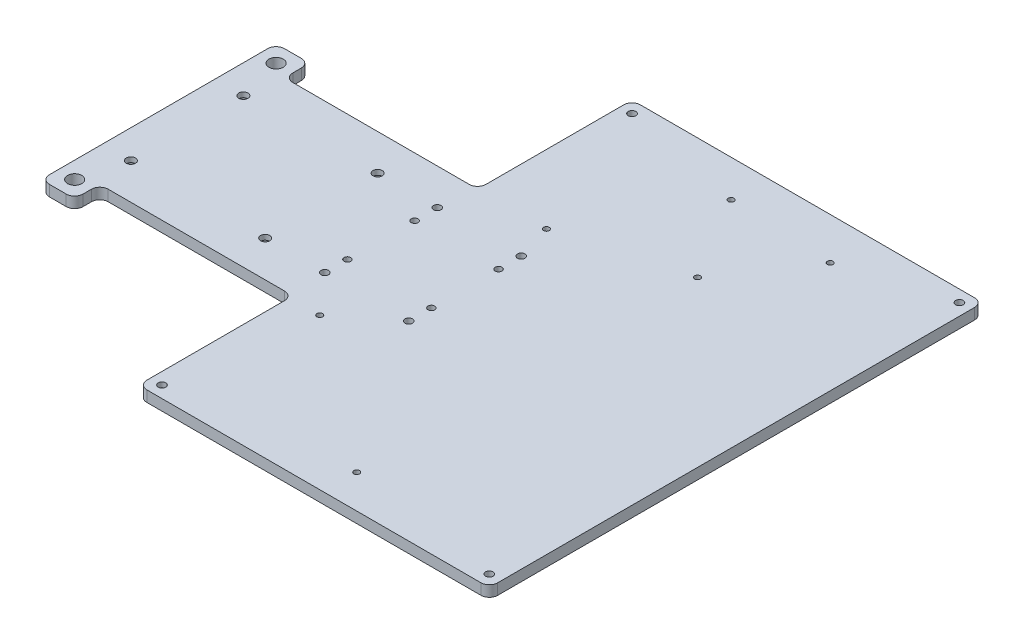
from build123d import *

# Parameters (mm, degrees)
BOSS_EXTRU_1_DEPTH                                 = 6.5
DIAM_TRE_DU_PER_AGE_8_5_8_5_1_D                    = 8.5
CHAMBRAGE_POUR_VIS_T_TE_HEXAGONALE_M51_D           = 5.5
CHAMBRAGE_POUR_VIS_T_TE_HEXAGONALE_M51_CBORE_D     = 10
CHAMBRAGE_POUR_VIS_T_TE_HEXAGONALE_M51_CBORE_DEPTH = 3.5
DIAM_TRE_DU_PER_AGE_4_0_4_1_D                      = 4
CHAMBRAGE_POUR_VIS_T_TE_HEXAGONALE_M41_D           = 4.5
CHAMBRAGE_POUR_VIS_T_TE_HEXAGONALE_M41_CBORE_D     = 8
CHAMBRAGE_POUR_VIS_T_TE_HEXAGONALE_M41_CBORE_DEPTH = 3.5
CONG_1_R                                           = 5
CHAMBRAGE_POUR_VIS_T_TE_HEXAGONALE_M31_D           = 3.4
CHAMBRAGE_POUR_VIS_T_TE_HEXAGONALE_M31_CBORE_D     = 6.5
CHAMBRAGE_POUR_VIS_T_TE_HEXAGONALE_M31_CBORE_DEPTH = 3.5


with BuildPart() as part:
    # Esquisse1 → Boss.-Extru.1 (new body)
    with BuildSketch(Plane(origin=(0, 0, 0), x_dir=(1, 0, 0), z_dir=(0, 1, 0))):
        Polygon((-132.5, 70), (-132.5, -70), (-112.5, -70), (-112.5, -55), (2.5, -55), (2.5, -147), (211.5, -147), (211.5, 147), (2.5, 147), (2.5, 55), (-112.5, 55), (-112.5, 70), align=None)
    extrude(amount=BOSS_EXTRU_1_DEPTH)

    # Diam_tre du per_age _8.5 _8.5_1 (through all)
    with Locations(Plane(origin=(0, 6.5, 0), x_dir=(1, 0, 0), z_dir=(0, 1, 0))):
        with Locations((-122.5, 60), (-122.5, -60)):
            Hole(DIAM_TRE_DU_PER_AGE_8_5_8_5_1_D / 2)

    # Chambrage pour vis _ t_te hexagonale M51 (through all)
    with Locations(Plane(origin=(0, 0, 0), x_dir=(-1, 0, 0), z_dir=(0, -1, 0))):
        with Locations((115.5, -33.5), (35.5, -33.5), (35.5, 33.5), (115.5, 33.5)):
            CounterBoreHole(CHAMBRAGE_POUR_VIS_T_TE_HEXAGONALE_M51_D / 2, CHAMBRAGE_POUR_VIS_T_TE_HEXAGONALE_M51_CBORE_D / 2, CHAMBRAGE_POUR_VIS_T_TE_HEXAGONALE_M51_CBORE_DEPTH)

    # Diam_tre du per_age _4.0 _4_1 (through all)
    with Locations(Plane(origin=(0, 0, 0), x_dir=(-1, 0, 0), z_dir=(0, -1, 0))):
        with Locations((0, -20), (0, 20), (-50, -20), (-50, 20)):
            Hole(DIAM_TRE_DU_PER_AGE_4_0_4_1_D / 2)

    # Chambrage pour vis _ t_te hexagonale M41 (through all)
    with Locations(Plane(origin=(0, 0, 0), x_dir=(-1, 0, 0), z_dir=(0, -1, 0))):
        with Locations((-50, -33.5), (-50, 33.5), (0, -33.5), (0, 33.5), (-204.5, -140), (-9.5, -140), (-9.5, 140), (-204.5, 140)):
            CounterBoreHole(CHAMBRAGE_POUR_VIS_T_TE_HEXAGONALE_M41_D / 2, CHAMBRAGE_POUR_VIS_T_TE_HEXAGONALE_M41_CBORE_D / 2, CHAMBRAGE_POUR_VIS_T_TE_HEXAGONALE_M41_CBORE_DEPTH)

    # Cong_1
    cong_1_edges = [part.edges().sort_by_distance(p)[0] for p in [
        (-112.5, 3.25, -70),
        (-112.5, 3.25, -55),
        (2.5, 3.25, -55),
        (2.5, 3.25, -147),
        (211.5, 3.25, -147),
        (211.5, 3.25, 147),
        (2.5, 3.25, 147),
        (2.5, 3.25, 55),
        (-112.5, 3.25, 55),
        (-112.5, 3.25, 70),
        (-132.5, 3.25, 70),
        (-132.5, 3.25, -70),
    ]]
    fillet(cong_1_edges, radius=CONG_1_R)

    # Chambrage pour vis _ t_te hexagonale M31 (through all)
    with Locations(Plane(origin=(0, 0, 0), x_dir=(-1, 0, 0), z_dir=(0, -1, 0))):
        with Locations((-112.5, -127), (-20.5, -57), (-145.5, 122), (-113.5, 75), (-43.5, 55), (-83.5, 125)):
            CounterBoreHole(CHAMBRAGE_POUR_VIS_T_TE_HEXAGONALE_M31_D / 2, CHAMBRAGE_POUR_VIS_T_TE_HEXAGONALE_M31_CBORE_D / 2, CHAMBRAGE_POUR_VIS_T_TE_HEXAGONALE_M31_CBORE_DEPTH)


solid = part.part
